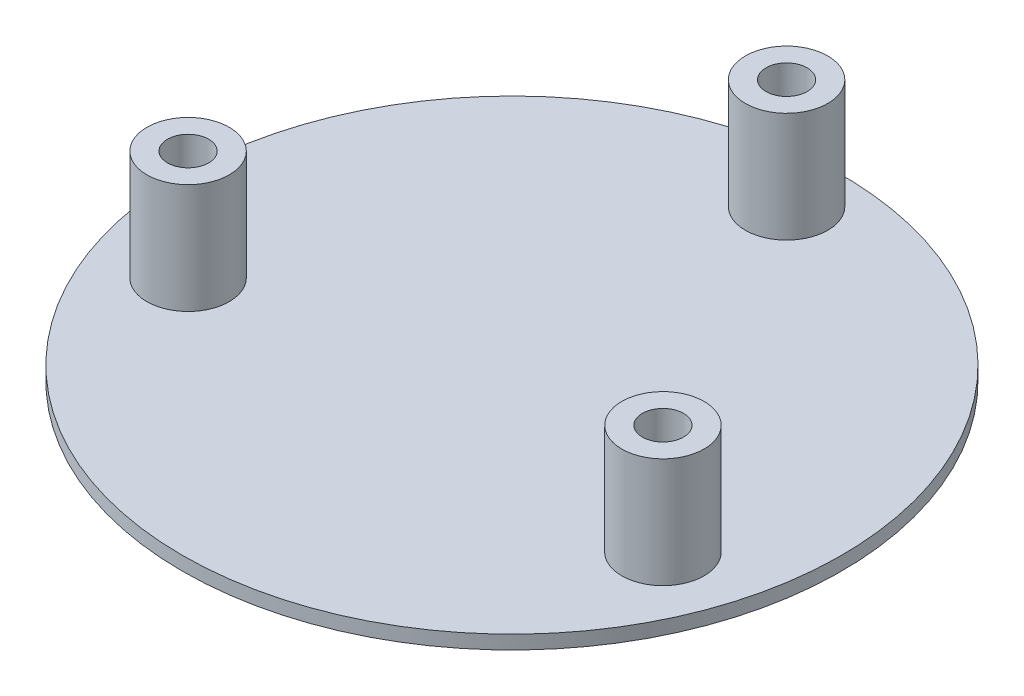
from build123d import *

# Parameters (mm, degrees)
SKETCH1_R           = 76.2
BOSS_EXTRUDE1_DEPTH = 3.175
SKETCH2_R           = 9.525
SKETCH2_R_2         = 4.7625
BOSS_EXTRUDE2_DEPTH = 25.4


with BuildPart() as part:
    # Sketch1 → Boss-Extrude1 (new body)
    with BuildSketch(Plane(origin=(0, 0, 0), x_dir=(1, 0, 0), z_dir=(0, 1, 0))):
        with Locations(Location((0, 0, 0), (0, 0, 270))):
            Circle(SKETCH1_R)
    extrude(amount=BOSS_EXTRUDE1_DEPTH)

    # Sketch2 → Boss-Extrude2 (add)
    # profile 1 of 3: a face of its own
    with BuildSketch(Plane(origin=(0, 3.175, 0), x_dir=(1, 0, 0), z_dir=(0, 1, 0))):
        with Locations(Location((0, 63.5, 0), (0, 0, 270))):
            Circle(SKETCH2_R)
        with Locations(Location((0, 63.5, 0), (0, 0, 270))):
            Circle(SKETCH2_R_2, mode=Mode.SUBTRACT)
    # profile 2 of 3: a face of its own
    with BuildSketch(Plane(origin=(0, 3.175, 0), x_dir=(1, 0, 0), z_dir=(0, 1, 0))):
        with Locations(Location((-54.896842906, -19.980816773, 0), (0, 0, 270))):
            Circle(SKETCH2_R)
        with Locations(Location((-54.896842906, -19.980816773, 0), (0, 0, 270))):
            Circle(SKETCH2_R_2, mode=Mode.SUBTRACT)
    # profile 3 of 3: a face of its own
    with BuildSketch(Plane(origin=(0, 3.175, 0), x_dir=(1, 0, 0), z_dir=(0, 1, 0))):
        with Locations(Location((54.896842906, -19.980816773, 0), (0, 0, 270))):
            Circle(SKETCH2_R)
        with Locations(Location((54.896842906, -19.980816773, 0), (0, 0, 270))):
            Circle(SKETCH2_R_2, mode=Mode.SUBTRACT)
    extrude(amount=BOSS_EXTRUDE2_DEPTH)


solid = part.part
